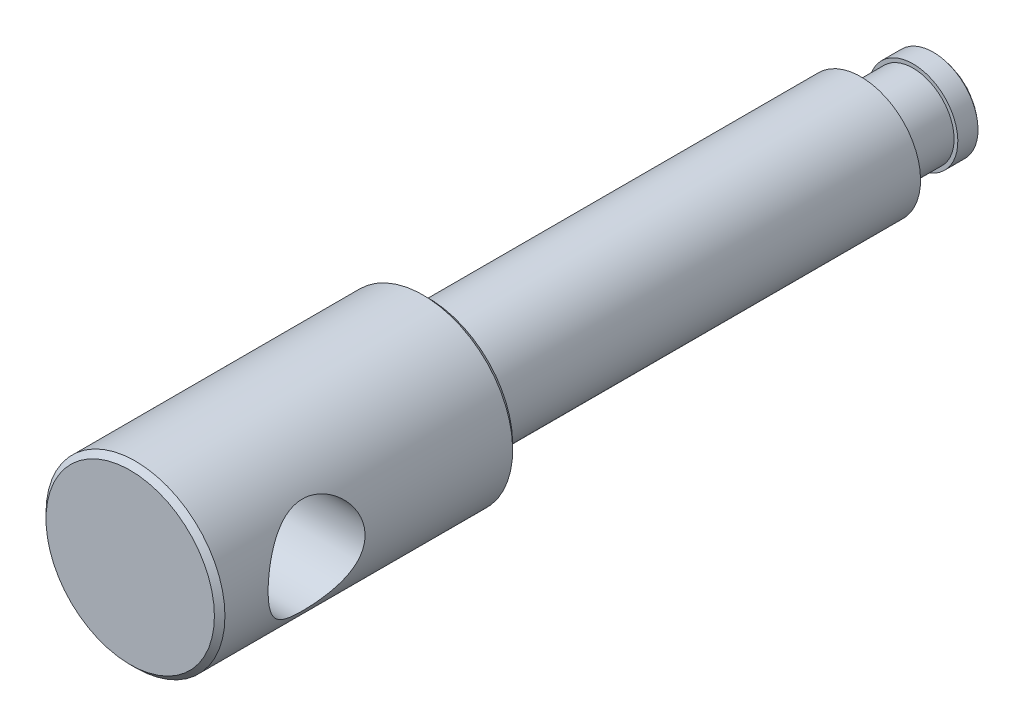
ISO-10303-21;
HEADER;
FILE_DESCRIPTION(('STEP AP214'),'2;1');
FILE_NAME('part.step','',(''),(''),'','','');
FILE_SCHEMA(('AUTOMOTIVE_DESIGN { 1 0 10303 214 1 1 1 1 }'));
ENDSEC;
DATA;
#1=APPLICATION_CONTEXT('core data for automotive mechanical design processes');
#2=APPLICATION_PROTOCOL_DEFINITION('international standard','automotive_design',2000,#1);
#3=PRODUCT_CONTEXT('',#1,'mechanical');
#4=PRODUCT('Part','Part','',(#3));
#5=PRODUCT_RELATED_PRODUCT_CATEGORY('part','',(#4));
#6=PRODUCT_DEFINITION_FORMATION('','',#4);
#7=PRODUCT_DEFINITION_CONTEXT('part definition',#1,'design');
#8=PRODUCT_DEFINITION('design','',#6,#7);
#9=PRODUCT_DEFINITION_SHAPE('','',#8);
#10=(LENGTH_UNIT() NAMED_UNIT(*) SI_UNIT(.MILLI.,.METRE.));
#11=(NAMED_UNIT(*) PLANE_ANGLE_UNIT() SI_UNIT($,.RADIAN.));
#12=(NAMED_UNIT(*) SI_UNIT($,.STERADIAN.) SOLID_ANGLE_UNIT());
#13=UNCERTAINTY_MEASURE_WITH_UNIT(LENGTH_MEASURE(1.E-05),#10,'distance_accuracy_value','');
#14=(GEOMETRIC_REPRESENTATION_CONTEXT(3) GLOBAL_UNCERTAINTY_ASSIGNED_CONTEXT((#13)) GLOBAL_UNIT_ASSIGNED_CONTEXT((#10,
#11,#12)) REPRESENTATION_CONTEXT('',''));
#15=CARTESIAN_POINT('',(0.,0.,0.));
#16=DIRECTION('',(0.,0.,1.));
#17=DIRECTION('',(1.,0.,0.));
#18=AXIS2_PLACEMENT_3D('',#15,#16,#17);
#19=CARTESIAN_POINT('',(0.,0.,9.));
#20=DIRECTION('',(-1.,0.,0.));
#21=DIRECTION('',(0.,1.,0.));
#22=AXIS2_PLACEMENT_3D('',#19,#20,#21);
#23=SPHERICAL_SURFACE('',#22,9.);
#24=CARTESIAN_POINT('',(0.,0.,2.29179606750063));
#25=DIRECTION('',(0.,0.,1.));
#26=DIRECTION('',(0.,-1.,0.));
#27=AXIS2_PLACEMENT_3D('',#24,#25,#26);
#28=CIRCLE('',#27,6.);
#29=CARTESIAN_POINT('',(0.,-6.,2.29179606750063));
#30=VERTEX_POINT('',#29);
#31=EDGE_CURVE('E112',#30,#30,#28,.T.);
#32=ORIENTED_EDGE('',*,*,#31,.F.);
#33=EDGE_LOOP('',(#32));
#34=FACE_BOUND('',#33,.T.);
#35=ADVANCED_FACE('F12',(#34),#23,.T.);
#36=CARTESIAN_POINT('',(0.,0.,0.));
#37=DIRECTION('',(0.,0.,1.));
#38=DIRECTION('',(0.,-1.,0.));
#39=AXIS2_PLACEMENT_3D('',#36,#37,#38);
#40=CYLINDRICAL_SURFACE('',#39,6.);
#41=CARTESIAN_POINT('',(0.,0.,5.));
#42=DIRECTION('',(0.,0.,1.));
#43=DIRECTION('',(0.,-1.,0.));
#44=AXIS2_PLACEMENT_3D('',#41,#42,#43);
#45=CIRCLE('',#44,6.);
#46=CARTESIAN_POINT('',(0.,-6.,5.));
#47=VERTEX_POINT('',#46);
#48=EDGE_CURVE('E113',#47,#47,#45,.F.);
#49=ORIENTED_EDGE('',*,*,#48,.T.);
#50=EDGE_LOOP('',(#49));
#51=FACE_BOUND('',#50,.T.);
#52=ORIENTED_EDGE('',*,*,#31,.T.);
#53=EDGE_LOOP('',(#52));
#54=FACE_BOUND('',#53,.T.);
#55=ADVANCED_FACE('F75',(#51,#54),#40,.T.);
#56=CARTESIAN_POINT('',(5.5,0.,5.));
#57=DIRECTION('',(0.,0.,-1.));
#58=DIRECTION('',(0.,1.,0.));
#59=AXIS2_PLACEMENT_3D('',#56,#57,#58);
#60=PLANE('',#59);
#61=CARTESIAN_POINT('',(0.,0.,5.));
#62=DIRECTION('',(0.,0.,1.));
#63=DIRECTION('',(0.,-1.,0.));
#64=AXIS2_PLACEMENT_3D('',#61,#62,#63);
#65=CIRCLE('',#64,5.5);
#66=CARTESIAN_POINT('',(0.,-5.5,5.));
#67=VERTEX_POINT('',#66);
#68=EDGE_CURVE('E94',#67,#67,#65,.T.);
#69=ORIENTED_EDGE('',*,*,#68,.F.);
#70=EDGE_LOOP('',(#69));
#71=FACE_BOUND('',#70,.T.);
#72=ORIENTED_EDGE('',*,*,#48,.F.);
#73=EDGE_LOOP('',(#72));
#74=FACE_BOUND('',#73,.T.);
#75=ADVANCED_FACE('F71',(#71,#74),#60,.F.);
#76=CARTESIAN_POINT('',(0.,0.,0.));
#77=DIRECTION('',(0.,0.,1.));
#78=DIRECTION('',(0.,-1.,0.));
#79=AXIS2_PLACEMENT_3D('',#76,#77,#78);
#80=CYLINDRICAL_SURFACE('',#79,5.5);
#81=CARTESIAN_POINT('',(0.,0.,10.5566243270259));
#82=DIRECTION('',(0.,0.,1.));
#83=DIRECTION('',(0.,-1.,0.));
#84=AXIS2_PLACEMENT_3D('',#81,#82,#83);
#85=CIRCLE('',#84,5.5);
#86=CARTESIAN_POINT('',(0.,-5.5,10.5566243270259));
#87=VERTEX_POINT('',#86);
#88=EDGE_CURVE('E90',#87,#87,#85,.T.);
#89=ORIENTED_EDGE('',*,*,#88,.F.);
#90=EDGE_LOOP('',(#89));
#91=FACE_BOUND('',#90,.T.);
#92=ORIENTED_EDGE('',*,*,#68,.T.);
#93=EDGE_LOOP('',(#92));
#94=FACE_BOUND('',#93,.T.);
#95=ADVANCED_FACE('F67',(#91,#94),#80,.T.);
#96=CARTESIAN_POINT('',(0.,0.,12.));
#97=DIRECTION('',(0.,0.,1.));
#98=DIRECTION('',(0.,-1.,0.));
#99=AXIS2_PLACEMENT_3D('',#96,#97,#98);
#100=CONICAL_SURFACE('',#99,8.,1.0471975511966);
#101=CARTESIAN_POINT('',(0.,0.,12.));
#102=DIRECTION('',(0.,0.,1.));
#103=DIRECTION('',(0.,-1.,0.));
#104=AXIS2_PLACEMENT_3D('',#101,#102,#103);
#105=CIRCLE('',#104,8.);
#106=CARTESIAN_POINT('',(0.,-8.,12.));
#107=VERTEX_POINT('',#106);
#108=EDGE_CURVE('E97',#107,#107,#105,.T.);
#109=ORIENTED_EDGE('',*,*,#108,.F.);
#110=EDGE_LOOP('',(#109));
#111=FACE_BOUND('',#110,.T.);
#112=ORIENTED_EDGE('',*,*,#88,.T.);
#113=EDGE_LOOP('',(#112));
#114=FACE_BOUND('',#113,.T.);
#115=ADVANCED_FACE('F63',(#111,#114),#100,.T.);
#116=CARTESIAN_POINT('',(0.,0.,0.));
#117=DIRECTION('',(0.,0.,1.));
#118=DIRECTION('',(0.,-1.,0.));
#119=AXIS2_PLACEMENT_3D('',#116,#117,#118);
#120=CYLINDRICAL_SURFACE('',#119,8.);
#121=CARTESIAN_POINT('',(0.,0.,70.));
#122=DIRECTION('',(0.,0.,1.));
#123=DIRECTION('',(0.,-1.,0.));
#124=AXIS2_PLACEMENT_3D('',#121,#122,#123);
#125=CIRCLE('',#124,8.);
#126=CARTESIAN_POINT('',(0.,-8.,70.));
#127=VERTEX_POINT('',#126);
#128=EDGE_CURVE('E93',#127,#127,#125,.F.);
#129=ORIENTED_EDGE('',*,*,#128,.T.);
#130=EDGE_LOOP('',(#129));
#131=FACE_BOUND('',#130,.T.);
#132=ORIENTED_EDGE('',*,*,#108,.T.);
#133=EDGE_LOOP('',(#132));
#134=FACE_BOUND('',#133,.T.);
#135=ADVANCED_FACE('F59',(#131,#134),#120,.T.);
#136=CARTESIAN_POINT('',(11.2928932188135,0.,70.));
#137=DIRECTION('',(0.,0.,1.));
#138=DIRECTION('',(0.,-1.,0.));
#139=AXIS2_PLACEMENT_3D('',#136,#137,#138);
#140=PLANE('',#139);
#141=CARTESIAN_POINT('',(0.,0.,70.));
#142=DIRECTION('',(0.,0.,1.));
#143=DIRECTION('',(0.,-1.,0.));
#144=AXIS2_PLACEMENT_3D('',#141,#142,#143);
#145=CIRCLE('',#144,11.2928932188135);
#146=CARTESIAN_POINT('',(0.,-11.2928932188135,70.));
#147=VERTEX_POINT('',#146);
#148=EDGE_CURVE('E100',#147,#147,#145,.T.);
#149=ORIENTED_EDGE('',*,*,#148,.F.);
#150=EDGE_LOOP('',(#149));
#151=FACE_BOUND('',#150,.T.);
#152=ORIENTED_EDGE('',*,*,#128,.F.);
#153=EDGE_LOOP('',(#152));
#154=FACE_BOUND('',#153,.T.);
#155=ADVANCED_FACE('F55',(#151,#154),#140,.F.);
#156=CARTESIAN_POINT('',(0.,0.,110.));
#157=DIRECTION('',(0.,0.,-1.));
#158=DIRECTION('',(0.,1.,0.));
#159=AXIS2_PLACEMENT_3D('',#156,#157,#158);
#160=PLANE('',#159);
#161=CARTESIAN_POINT('',(0.,0.,110.));
#162=DIRECTION('',(0.,0.,-1.));
#163=DIRECTION('',(1.,0.,0.));
#164=AXIS2_PLACEMENT_3D('',#161,#162,#163);
#165=CIRCLE('',#164,11.2928932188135);
#166=CARTESIAN_POINT('',(11.2928932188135,0.,110.));
#167=VERTEX_POINT('',#166);
#168=EDGE_CURVE('E86',#167,#167,#165,.T.);
#169=ORIENTED_EDGE('',*,*,#168,.F.);
#170=EDGE_LOOP('',(#169));
#171=FACE_BOUND('',#170,.T.);
#172=ADVANCED_FACE('F51',(#171),#160,.F.);
#173=CARTESIAN_POINT('',(0.,0.,70.7071067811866));
#174=DIRECTION('',(0.,0.,1.));
#175=DIRECTION('',(0.,-1.,0.));
#176=AXIS2_PLACEMENT_3D('',#173,#174,#175);
#177=CONICAL_SURFACE('',#176,12.,0.785398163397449);
#178=CARTESIAN_POINT('',(0.,0.,70.7071067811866));
#179=DIRECTION('',(0.,0.,1.));
#180=DIRECTION('',(0.,-1.,0.));
#181=AXIS2_PLACEMENT_3D('',#178,#179,#180);
#182=CIRCLE('',#181,12.);
#183=CARTESIAN_POINT('',(0.,-12.,70.7071067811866));
#184=VERTEX_POINT('',#183);
#185=EDGE_CURVE('E27',#184,#184,#182,.T.);
#186=ORIENTED_EDGE('',*,*,#185,.F.);
#187=EDGE_LOOP('',(#186));
#188=FACE_BOUND('',#187,.T.);
#189=ORIENTED_EDGE('',*,*,#148,.T.);
#190=EDGE_LOOP('',(#189));
#191=FACE_BOUND('',#190,.T.);
#192=ADVANCED_FACE('F47',(#188,#191),#177,.T.);
#193=CARTESIAN_POINT('',(0.,0.,109.292893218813));
#194=DIRECTION('',(0.,0.,-1.));
#195=DIRECTION('',(1.,0.,0.));
#196=AXIS2_PLACEMENT_3D('',#193,#194,#195);
#197=CONICAL_SURFACE('',#196,12.0000000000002,0.78539816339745);
#198=ORIENTED_EDGE('',*,*,#168,.T.);
#199=EDGE_LOOP('',(#198));
#200=FACE_BOUND('',#199,.T.);
#201=CARTESIAN_POINT('',(0.,0.,109.292893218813));
#202=DIRECTION('',(0.,0.,1.));
#203=DIRECTION('',(0.,-1.,0.));
#204=AXIS2_PLACEMENT_3D('',#201,#202,#203);
#205=CIRCLE('',#204,12.);
#206=CARTESIAN_POINT('',(0.,-12.,109.292893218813));
#207=VERTEX_POINT('',#206);
#208=EDGE_CURVE('E31',#207,#207,#205,.F.);
#209=ORIENTED_EDGE('',*,*,#208,.F.);
#210=EDGE_LOOP('',(#209));
#211=FACE_BOUND('',#210,.T.);
#212=ADVANCED_FACE('F42',(#200,#211),#197,.T.);
#213=CARTESIAN_POINT('',(0.,0.,0.));
#214=DIRECTION('',(0.,0.,1.));
#215=DIRECTION('',(0.,-1.,0.));
#216=AXIS2_PLACEMENT_3D('',#213,#214,#215);
#217=CYLINDRICAL_SURFACE('',#216,12.);
#218=CARTESIAN_POINT('',(-10.087120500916,6.5,97.));
#219=CARTESIAN_POINT('',(-10.087118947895,6.50000119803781,96.8328756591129));
#220=CARTESIAN_POINT('',(-10.0912874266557,6.49354678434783,96.6657648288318));
#221=CARTESIAN_POINT('',(-10.1077896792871,6.46782984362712,96.3328781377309));
#222=CARTESIAN_POINT('',(-10.1201263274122,6.44856280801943,96.1671027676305));
#223=CARTESIAN_POINT('',(-10.1524999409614,6.39747254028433,95.8380599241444));
#224=CARTESIAN_POINT('',(-10.1725465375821,6.36563360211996,95.6747958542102));
#225=CARTESIAN_POINT('',(-10.2195968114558,6.28981935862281,95.3520727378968));
#226=CARTESIAN_POINT('',(-10.2466035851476,6.24583865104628,95.1926154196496));
#227=CARTESIAN_POINT('',(-10.3064421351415,6.14659096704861,94.8795748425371));
#228=CARTESIAN_POINT('',(-10.3392345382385,6.09139991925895,94.7259599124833));
#229=CARTESIAN_POINT('',(-10.4097518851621,5.97009096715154,94.4242527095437));
#230=CARTESIAN_POINT('',(-10.4474786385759,5.9039690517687,94.2761624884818));
#231=CARTESIAN_POINT('',(-10.5664492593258,5.69005888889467,93.8412761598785));
#232=CARTESIAN_POINT('',(-10.6535335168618,5.52664700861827,93.5636176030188));
#233=CARTESIAN_POINT('',(-10.8437484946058,5.14421208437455,93.0111716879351));
#234=CARTESIAN_POINT('',(-10.9476156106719,4.9213132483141,92.7393209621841));
#235=CARTESIAN_POINT('',(-11.1021466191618,4.55630390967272,92.3609403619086));
#236=CARTESIAN_POINT('',(-11.1534773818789,4.42943405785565,92.2396454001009));
#237=CARTESIAN_POINT('',(-11.2545668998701,4.16588742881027,92.0073833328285));
#238=CARTESIAN_POINT('',(-11.3043253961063,4.02920904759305,91.8964179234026));
#239=CARTESIAN_POINT('',(-11.4051037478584,3.73493814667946,91.676778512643));
#240=CARTESIAN_POINT('',(-11.4558859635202,3.57655121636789,91.5690577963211));
#241=CARTESIAN_POINT('',(-11.5527965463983,3.24990680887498,91.3675127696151));
#242=CARTESIAN_POINT('',(-11.5989269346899,3.08165366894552,91.2736824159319));
#243=CARTESIAN_POINT('',(-11.6852214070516,2.7362872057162,91.100847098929));
#244=CARTESIAN_POINT('',(-11.725387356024,2.55917667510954,91.0218374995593));
#245=CARTESIAN_POINT('',(-11.798554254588,2.1973105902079,90.8795746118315));
#246=CARTESIAN_POINT('',(-11.8315561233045,2.01255602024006,90.8163193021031));
#247=CARTESIAN_POINT('',(-11.8870041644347,1.65215873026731,90.7109056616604));
#248=CARTESIAN_POINT('',(-11.9100894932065,1.47699280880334,90.6674520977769));
#249=CARTESIAN_POINT('',(-11.9486794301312,1.12284285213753,90.5951676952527));
#250=CARTESIAN_POINT('',(-11.9641844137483,0.943859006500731,90.566336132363));
#251=CARTESIAN_POINT('',(-11.9871526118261,0.583705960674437,90.5237240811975));
#252=CARTESIAN_POINT('',(-11.9946207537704,0.402538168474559,90.5099343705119));
#253=CARTESIAN_POINT('',(-12.0013074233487,0.0395375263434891,90.497584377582));
#254=CARTESIAN_POINT('',(-12.0005265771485,-0.142295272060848,90.499022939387));
#255=CARTESIAN_POINT('',(-11.9912428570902,-0.486463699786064,90.5161781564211));
#256=CARTESIAN_POINT('',(-11.9835355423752,-0.648896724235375,90.5304238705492));
#257=CARTESIAN_POINT('',(-11.9616756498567,-0.971862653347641,90.5710049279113));
#258=CARTESIAN_POINT('',(-11.94752092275,-1.13239490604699,90.5973443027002));
#259=CARTESIAN_POINT('',(-11.913104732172,-1.45034460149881,90.6617979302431));
#260=CARTESIAN_POINT('',(-11.8928454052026,-1.60776311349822,90.6999080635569));
#261=CARTESIAN_POINT('',(-11.8466723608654,-1.91860842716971,90.7875101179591));
#262=CARTESIAN_POINT('',(-11.820756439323,-2.07203364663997,90.8370064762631));
#263=CARTESIAN_POINT('',(-11.763526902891,-2.37561538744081,90.9474943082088));
#264=CARTESIAN_POINT('',(-11.7321572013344,-2.52571759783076,91.0086059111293));
#265=CARTESIAN_POINT('',(-11.6648916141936,-2.82013189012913,91.1414196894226));
#266=CARTESIAN_POINT('',(-11.6289942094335,-2.96444200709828,91.2131254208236));
#267=CARTESIAN_POINT('',(-11.5156109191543,-3.38759543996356,91.4432730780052));
#268=CARTESIAN_POINT('',(-11.4323975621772,-3.65684755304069,91.6168137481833));
#269=CARTESIAN_POINT('',(-11.2478649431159,-4.19213402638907,92.0200480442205));
#270=CARTESIAN_POINT('',(-11.1455615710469,-4.45481814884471,92.2537387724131));
#271=CARTESIAN_POINT('',(-10.9911490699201,-4.81788921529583,92.6332291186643));
#272=CARTESIAN_POINT('',(-10.9394753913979,-4.933837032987,92.7646727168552));
#273=CARTESIAN_POINT('',(-10.8370351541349,-5.15494824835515,93.0367657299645));
#274=CARTESIAN_POINT('',(-10.7862687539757,-5.26010977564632,93.1774167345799));
#275=CARTESIAN_POINT('',(-10.6828047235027,-5.46737700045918,93.4794745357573));
#276=CARTESIAN_POINT('',(-10.6303021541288,-5.56848689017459,93.6416327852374));
#277=CARTESIAN_POINT('',(-10.5296797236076,-5.75649288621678,93.9751992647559));
#278=CARTESIAN_POINT('',(-10.4815578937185,-5.84339539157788,94.1466032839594));
#279=CARTESIAN_POINT('',(-10.3914773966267,-6.00212687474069,94.4976892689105));
#280=CARTESIAN_POINT('',(-10.349514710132,-6.07396569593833,94.677365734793));
#281=CARTESIAN_POINT('',(-10.2734696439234,-6.20172232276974,95.0439097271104));
#282=CARTESIAN_POINT('',(-10.2393860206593,-6.25764264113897,95.2307761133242));
#283=CARTESIAN_POINT('',(-10.183067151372,-6.34884087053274,95.5948225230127));
#284=CARTESIAN_POINT('',(-10.1600959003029,-6.38542375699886,95.7715614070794));
#285=CARTESIAN_POINT('',(-10.1231525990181,-6.44383305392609,96.1283981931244));
#286=CARTESIAN_POINT('',(-10.1091799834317,-6.46566039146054,96.3084958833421));
#287=CARTESIAN_POINT('',(-10.0908950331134,-6.49416095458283,96.67021537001));
#288=CARTESIAN_POINT('',(-10.0865740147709,-6.50084780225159,96.8518356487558));
#289=CARTESIAN_POINT('',(-10.0877775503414,-6.49898061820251,97.2149553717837));
#290=CARTESIAN_POINT('',(-10.0933011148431,-6.49042811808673,97.3964548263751));
#291=CARTESIAN_POINT('',(-10.1124808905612,-6.46049409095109,97.7323705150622));
#292=CARTESIAN_POINT('',(-10.1248969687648,-6.44106571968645,97.8870373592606));
#293=CARTESIAN_POINT('',(-10.1563891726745,-6.39129308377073,98.193964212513));
#294=CARTESIAN_POINT('',(-10.1754674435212,-6.36094530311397,98.3462234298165));
#295=CARTESIAN_POINT('',(-10.2196651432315,-6.28968973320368,98.6473418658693));
#296=CARTESIAN_POINT('',(-10.24478424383,-6.24878251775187,98.796201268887));
#297=CARTESIAN_POINT('',(-10.3003063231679,-6.15683127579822,99.0897666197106));
#298=CARTESIAN_POINT('',(-10.3307114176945,-6.10578318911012,99.2344708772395));
#299=CARTESIAN_POINT('',(-10.4314159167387,-5.93327889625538,99.6735187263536));
#300=CARTESIAN_POINT('',(-10.5092162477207,-5.79551066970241,99.9599297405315));
#301=CARTESIAN_POINT('',(-10.6762160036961,-5.48178778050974,100.50710512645));
#302=CARTESIAN_POINT('',(-10.7654211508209,-5.30581391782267,100.767856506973));
#303=CARTESIAN_POINT('',(-10.9615933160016,-4.88917754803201,101.298392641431));
#304=CARTESIAN_POINT('',(-11.0691920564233,-4.64273975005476,101.563473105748));
#305=CARTESIAN_POINT('',(-11.2261517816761,-4.24196259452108,101.928337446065));
#306=CARTESIAN_POINT('',(-11.2777643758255,-4.10308206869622,102.044565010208));
#307=CARTESIAN_POINT('',(-11.378301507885,-3.81542023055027,102.265494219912));
#308=CARTESIAN_POINT('',(-11.427225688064,-3.66663760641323,102.370194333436));
#309=CARTESIAN_POINT('',(-11.5233155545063,-3.35281482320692,102.571805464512));
#310=CARTESIAN_POINT('',(-11.5702947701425,-3.18734081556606,102.668130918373));
#311=CARTESIAN_POINT('',(-11.6586044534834,-2.8474119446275,102.846284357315));
#312=CARTESIAN_POINT('',(-11.699937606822,-2.67296140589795,102.928119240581));
#313=CARTESIAN_POINT('',(-11.7757388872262,-2.3162883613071,103.076354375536));
#314=CARTESIAN_POINT('',(-11.8102108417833,-2.13407025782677,103.142763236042));
#315=CARTESIAN_POINT('',(-11.8712409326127,-1.76321621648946,103.259299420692));
#316=CARTESIAN_POINT('',(-11.897800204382,-1.57458120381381,103.309429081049));
#317=CARTESIAN_POINT('',(-11.9399132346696,-1.21177627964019,103.388468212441));
#318=CARTESIAN_POINT('',(-11.9563044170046,-1.03805633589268,103.419003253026));
#319=CARTESIAN_POINT('',(-11.9815348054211,-0.68816884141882,103.465877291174));
#320=CARTESIAN_POINT('',(-11.9903745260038,-0.512001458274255,103.482217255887));
#321=CARTESIAN_POINT('',(-12.0002498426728,-0.158776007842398,103.500465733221));
#322=CARTESIAN_POINT('',(-12.0012886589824,0.0182816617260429,103.502380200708));
#323=CARTESIAN_POINT('',(-11.9955405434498,0.371831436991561,103.491765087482));
#324=CARTESIAN_POINT('',(-11.9887539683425,0.548323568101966,103.479236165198));
#325=CARTESIAN_POINT('',(-11.9684587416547,0.884220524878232,103.441601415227));
#326=CARTESIAN_POINT('',(-11.955574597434,1.04379585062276,103.417662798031));
#327=CARTESIAN_POINT('',(-11.9237226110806,1.36019350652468,103.358128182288));
#328=CARTESIAN_POINT('',(-11.9047527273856,1.51701489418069,103.322528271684));
#329=CARTESIAN_POINT('',(-11.8611656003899,1.82680418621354,103.240069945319));
#330=CARTESIAN_POINT('',(-11.8365501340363,1.97977328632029,103.19321507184));
#331=CARTESIAN_POINT('',(-11.7821936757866,2.28108822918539,103.088684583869));
#332=CARTESIAN_POINT('',(-11.7524506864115,2.42943224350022,103.031004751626));
#333=CARTESIAN_POINT('',(-11.6873202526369,2.72587240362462,102.903100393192));
#334=CARTESIAN_POINT('',(-11.6517694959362,2.87377152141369,102.832502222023));
#335=CARTESIAN_POINT('',(-11.5765941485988,3.16304240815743,102.680832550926));
#336=CARTESIAN_POINT('',(-11.5369681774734,3.30441194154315,102.599757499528));
#337=CARTESIAN_POINT('',(-11.4131894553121,3.71775123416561,102.341701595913));
#338=CARTESIAN_POINT('',(-11.324101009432,3.97910456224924,102.149823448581));
#339=CARTESIAN_POINT('',(-11.1293540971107,4.49693418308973,101.707057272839));
#340=CARTESIAN_POINT('',(-11.0229598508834,4.74953907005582,101.451955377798));
#341=CARTESIAN_POINT('',(-10.865503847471,5.09479556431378,101.040448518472));
#342=CARTESIAN_POINT('',(-10.8133263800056,5.20435968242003,100.898323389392));
#343=CARTESIAN_POINT('',(-10.7110504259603,5.41172260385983,100.60492903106));
#344=CARTESIAN_POINT('',(-10.6609522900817,5.50951942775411,100.453658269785));
#345=CARTESIAN_POINT('',(-10.561377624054,5.69819013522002,100.133250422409));
#346=CARTESIAN_POINT('',(-10.512122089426,5.78828717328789,99.963586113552));
#347=CARTESIAN_POINT('',(-10.4194004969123,5.95357648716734,99.6157183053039));
#348=CARTESIAN_POINT('',(-10.3759314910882,6.02877636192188,99.4375192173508));
#349=CARTESIAN_POINT('',(-10.2966205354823,6.16325352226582,99.0740667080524));
#350=CARTESIAN_POINT('',(-10.2607600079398,6.22256968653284,98.8888318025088));
#351=CARTESIAN_POINT('',(-10.1981899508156,6.324595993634,98.5124375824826));
#352=CARTESIAN_POINT('',(-10.1714744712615,6.36731693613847,98.3212822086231));
#353=CARTESIAN_POINT('',(-10.1293959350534,6.43403702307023,97.9426526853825));
#354=CARTESIAN_POINT('',(-10.1136130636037,6.45873074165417,97.7553479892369));
#355=CARTESIAN_POINT('',(-10.0924761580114,6.49171165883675,97.3786897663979));
#356=CARTESIAN_POINT('',(-10.0871222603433,6.49999864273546,97.1893362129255));
#357=CARTESIAN_POINT('',(-10.087120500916,6.5,97.));
#358=B_SPLINE_CURVE_WITH_KNOTS('',3,(#218,#219,#220,#221,#222,#223,#224,#225,#226,#227,#228,
#229,#230,#231,#232,#233,#234,#235,#236,#237,#238,#239,#240,#241,#242,#243,#244,#245,#246,#247,
#248,#249,#250,#251,#252,#253,#254,#255,#256,#257,#258,#259,#260,#261,#262,#263,#264,#265,#266,
#267,#268,#269,#270,#271,#272,#273,#274,#275,#276,#277,#278,#279,#280,#281,#282,#283,#284,#285,
#286,#287,#288,#289,#290,#291,#292,#293,#294,#295,#296,#297,#298,#299,#300,#301,#302,#303,#304,
#305,#306,#307,#308,#309,#310,#311,#312,#313,#314,#315,#316,#317,#318,#319,#320,#321,#322,#323,
#324,#325,#326,#327,#328,#329,#330,#331,#332,#333,#334,#335,#336,#337,#338,#339,#340,#341,#342,
#343,#344,#345,#346,#347,#348,#349,#350,#351,#352,#353,#354,#355,#356,#357),.UNSPECIFIED.,.T.,
.F.,(4,2,2,2,2,2,2,2,2,2,2,2,2,2,2,2,2,2,2,2,2,2,2,2,2,2,2,2,2,2,2,2,2,2,2,2,2,2,2,2,2,2,2,2,2,
2,2,2,2,2,2,2,2,2,2,2,2,2,2,2,2,2,2,2,2,2,2,2,2,4),(0.,0.501175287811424,1.00252702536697,
1.50450709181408,2.00671086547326,2.50562026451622,3.00471314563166,4.0021156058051,
5.09706524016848,5.64523335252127,6.19349131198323,6.78721913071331,7.38068787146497,
7.97397065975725,8.56717728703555,9.11225779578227,9.65731130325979,10.2020304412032,
10.7467082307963,11.2358435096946,11.7251419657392,12.2142693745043,12.7035877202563,
13.1982731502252,13.6931250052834,14.6822316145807,15.7759181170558,16.3236710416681,
16.8715187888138,17.4653089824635,18.0588309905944,18.6519639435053,19.2450032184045,
19.7900148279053,20.3349921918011,20.8794790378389,21.423911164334,21.8924997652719,
22.3612393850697,22.8299535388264,23.2988557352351,24.2763506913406,25.2543380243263,
26.3817148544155,26.9461447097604,27.5106494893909,28.1013064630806,28.6916814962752,
29.2817262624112,29.8716863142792,30.4023944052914,30.9330663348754,31.4635191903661,
31.9939478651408,32.4790142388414,32.9642435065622,33.449320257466,33.9345864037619,
34.4371369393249,34.9398582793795,35.9447953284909,37.0630240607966,37.6231922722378,
38.1834545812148,38.7776141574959,39.3714698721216,39.9638584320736,40.5558608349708,
41.123638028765,41.6914226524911),.UNSPECIFIED.);
#359=CARTESIAN_POINT('',(-10.087120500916,6.5,97.));
#360=VERTEX_POINT('',#359);
#361=EDGE_CURVE('E23',#360,#360,#358,.T.);
#362=ORIENTED_EDGE('',*,*,#361,.F.);
#363=EDGE_LOOP('',(#362));
#364=FACE_BOUND('',#363,.T.);
#365=ORIENTED_EDGE('',*,*,#208,.T.);
#366=EDGE_LOOP('',(#365));
#367=FACE_BOUND('',#366,.T.);
#368=CARTESIAN_POINT('',(10.087120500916,6.5,97.));
#369=CARTESIAN_POINT('',(10.087118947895,6.50000119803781,97.1671243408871));
#370=CARTESIAN_POINT('',(10.0912874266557,6.49354678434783,97.3342351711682));
#371=CARTESIAN_POINT('',(10.1077896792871,6.46782984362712,97.6671218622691));
#372=CARTESIAN_POINT('',(10.1201263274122,6.44856280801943,97.8328972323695));
#373=CARTESIAN_POINT('',(10.1524999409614,6.39747254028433,98.1619400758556));
#374=CARTESIAN_POINT('',(10.1725465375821,6.36563360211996,98.3252041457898));
#375=CARTESIAN_POINT('',(10.2195968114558,6.28981935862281,98.6479272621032));
#376=CARTESIAN_POINT('',(10.2466035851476,6.24583865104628,98.8073845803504));
#377=CARTESIAN_POINT('',(10.3064421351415,6.14659096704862,99.1204251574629));
#378=CARTESIAN_POINT('',(10.3392345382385,6.09139991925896,99.2740400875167));
#379=CARTESIAN_POINT('',(10.4097518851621,5.97009096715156,99.5757472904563));
#380=CARTESIAN_POINT('',(10.4474786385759,5.90396905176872,99.7238375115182));
#381=CARTESIAN_POINT('',(10.5664492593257,5.6900588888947,100.158723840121));
#382=CARTESIAN_POINT('',(10.6535335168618,5.52664700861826,100.436382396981));
#383=CARTESIAN_POINT('',(10.8437484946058,5.14421208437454,100.988828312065));
#384=CARTESIAN_POINT('',(10.9476156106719,4.92131324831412,101.260679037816));
#385=CARTESIAN_POINT('',(11.1021466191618,4.55630390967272,101.639059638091));
#386=CARTESIAN_POINT('',(11.1534773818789,4.42943405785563,101.760354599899));
#387=CARTESIAN_POINT('',(11.2545668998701,4.16588742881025,101.992616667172));
#388=CARTESIAN_POINT('',(11.3043253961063,4.02920904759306,102.103582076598));
#389=CARTESIAN_POINT('',(11.4051037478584,3.73493814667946,102.323221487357));
#390=CARTESIAN_POINT('',(11.4558859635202,3.57655121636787,102.430942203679));
#391=CARTESIAN_POINT('',(11.5527965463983,3.24990680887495,102.632487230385));
#392=CARTESIAN_POINT('',(11.5989269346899,3.08165366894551,102.726317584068));
#393=CARTESIAN_POINT('',(11.6852214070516,2.73628720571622,102.899152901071));
#394=CARTESIAN_POINT('',(11.725387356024,2.55917667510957,102.978162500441));
#395=CARTESIAN_POINT('',(11.798554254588,2.19731059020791,103.120425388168));
#396=CARTESIAN_POINT('',(11.8315561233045,2.01255602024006,103.183680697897));
#397=CARTESIAN_POINT('',(11.8870041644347,1.65215873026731,103.28909433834));
#398=CARTESIAN_POINT('',(11.9100894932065,1.47699280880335,103.332547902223));
#399=CARTESIAN_POINT('',(11.9486794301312,1.12284285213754,103.404832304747));
#400=CARTESIAN_POINT('',(11.9641844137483,0.943859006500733,103.433663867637));
#401=CARTESIAN_POINT('',(11.9871526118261,0.583705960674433,103.476275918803));
#402=CARTESIAN_POINT('',(11.9946207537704,0.402538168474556,103.490065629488));
#403=CARTESIAN_POINT('',(12.0013074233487,0.0395375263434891,103.502415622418));
#404=CARTESIAN_POINT('',(12.0005265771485,-0.142295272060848,103.500977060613));
#405=CARTESIAN_POINT('',(11.9912428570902,-0.486463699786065,103.483821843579));
#406=CARTESIAN_POINT('',(11.9835355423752,-0.648896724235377,103.469576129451));
#407=CARTESIAN_POINT('',(11.9616756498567,-0.971862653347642,103.428995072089));
#408=CARTESIAN_POINT('',(11.94752092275,-1.13239490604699,103.4026556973));
#409=CARTESIAN_POINT('',(11.913104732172,-1.45034460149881,103.338202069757));
#410=CARTESIAN_POINT('',(11.8928454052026,-1.60776311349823,103.300091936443));
#411=CARTESIAN_POINT('',(11.8466723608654,-1.91860842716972,103.212489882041));
#412=CARTESIAN_POINT('',(11.820756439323,-2.07203364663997,103.162993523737));
#413=CARTESIAN_POINT('',(11.763526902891,-2.37561538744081,103.052505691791));
#414=CARTESIAN_POINT('',(11.7321572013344,-2.52571759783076,102.991394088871));
#415=CARTESIAN_POINT('',(11.6648916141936,-2.82013189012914,102.858580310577));
#416=CARTESIAN_POINT('',(11.6289942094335,-2.96444200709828,102.786874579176));
#417=CARTESIAN_POINT('',(11.5156109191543,-3.38759543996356,102.556726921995));
#418=CARTESIAN_POINT('',(11.4323975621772,-3.65684755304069,102.383186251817));
#419=CARTESIAN_POINT('',(11.2478649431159,-4.19213402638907,101.97995195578));
#420=CARTESIAN_POINT('',(11.1455615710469,-4.45481814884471,101.746261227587));
#421=CARTESIAN_POINT('',(10.9911490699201,-4.81788921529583,101.366770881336));
#422=CARTESIAN_POINT('',(10.9394753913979,-4.933837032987,101.235327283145));
#423=CARTESIAN_POINT('',(10.8370351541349,-5.15494824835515,100.963234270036));
#424=CARTESIAN_POINT('',(10.7862687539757,-5.26010977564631,100.82258326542));
#425=CARTESIAN_POINT('',(10.6828047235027,-5.46737700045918,100.520525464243));
#426=CARTESIAN_POINT('',(10.6303021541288,-5.56848689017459,100.358367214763));
#427=CARTESIAN_POINT('',(10.5296797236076,-5.75649288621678,100.024800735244));
#428=CARTESIAN_POINT('',(10.4815578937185,-5.84339539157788,99.8533967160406));
#429=CARTESIAN_POINT('',(10.3914773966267,-6.00212687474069,99.5023107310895));
#430=CARTESIAN_POINT('',(10.349514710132,-6.07396569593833,99.322634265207));
#431=CARTESIAN_POINT('',(10.2734696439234,-6.20172232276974,98.9560902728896));
#432=CARTESIAN_POINT('',(10.2393860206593,-6.25764264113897,98.7692238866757));
#433=CARTESIAN_POINT('',(10.183067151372,-6.34884087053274,98.4051774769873));
#434=CARTESIAN_POINT('',(10.1600959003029,-6.38542375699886,98.2284385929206));
#435=CARTESIAN_POINT('',(10.1231525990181,-6.44383305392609,97.8716018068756));
#436=CARTESIAN_POINT('',(10.1091799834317,-6.46566039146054,97.6915041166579));
#437=CARTESIAN_POINT('',(10.0908950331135,-6.49416095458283,97.32978462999));
#438=CARTESIAN_POINT('',(10.0865740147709,-6.50084780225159,97.1481643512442));
#439=CARTESIAN_POINT('',(10.0877775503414,-6.49898061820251,96.7850446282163));
#440=CARTESIAN_POINT('',(10.0933011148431,-6.49042811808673,96.6035451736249));
#441=CARTESIAN_POINT('',(10.1124808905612,-6.46049409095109,96.2676294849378));
#442=CARTESIAN_POINT('',(10.1248969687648,-6.44106571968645,96.1129626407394));
#443=CARTESIAN_POINT('',(10.1563891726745,-6.39129308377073,95.806035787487));
#444=CARTESIAN_POINT('',(10.1754674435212,-6.36094530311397,95.6537765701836));
#445=CARTESIAN_POINT('',(10.2196651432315,-6.28968973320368,95.3526581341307));
#446=CARTESIAN_POINT('',(10.24478424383,-6.24878251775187,95.203798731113));
#447=CARTESIAN_POINT('',(10.3003063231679,-6.15683127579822,94.9102333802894));
#448=CARTESIAN_POINT('',(10.3307114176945,-6.10578318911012,94.7655291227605));
#449=CARTESIAN_POINT('',(10.4314159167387,-5.93327889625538,94.3264812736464));
#450=CARTESIAN_POINT('',(10.5092162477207,-5.79551066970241,94.0400702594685));
#451=CARTESIAN_POINT('',(10.6762160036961,-5.48178778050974,93.4928948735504));
#452=CARTESIAN_POINT('',(10.7654211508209,-5.30581391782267,93.2321434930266));
#453=CARTESIAN_POINT('',(10.9615933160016,-4.88917754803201,92.7016073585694));
#454=CARTESIAN_POINT('',(11.0691920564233,-4.64273975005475,92.4365268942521));
#455=CARTESIAN_POINT('',(11.2261517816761,-4.24196259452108,92.0716625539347));
#456=CARTESIAN_POINT('',(11.2777643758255,-4.10308206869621,91.9554349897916));
#457=CARTESIAN_POINT('',(11.378301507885,-3.81542023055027,91.7345057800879));
#458=CARTESIAN_POINT('',(11.427225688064,-3.66663760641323,91.6298056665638));
#459=CARTESIAN_POINT('',(11.5233155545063,-3.35281482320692,91.4281945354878));
#460=CARTESIAN_POINT('',(11.5702947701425,-3.18734081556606,91.3318690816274));
#461=CARTESIAN_POINT('',(11.6586044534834,-2.8474119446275,91.1537156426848));
#462=CARTESIAN_POINT('',(11.699937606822,-2.67296140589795,91.0718807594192));
#463=CARTESIAN_POINT('',(11.7757388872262,-2.3162883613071,90.9236456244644));
#464=CARTESIAN_POINT('',(11.8102108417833,-2.13407025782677,90.8572367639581));
#465=CARTESIAN_POINT('',(11.8712409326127,-1.76321621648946,90.7407005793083));
#466=CARTESIAN_POINT('',(11.897800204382,-1.57458120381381,90.6905709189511));
#467=CARTESIAN_POINT('',(11.9399132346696,-1.21177627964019,90.6115317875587));
#468=CARTESIAN_POINT('',(11.9563044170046,-1.03805633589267,90.5809967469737));
#469=CARTESIAN_POINT('',(11.9815348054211,-0.688168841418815,90.5341227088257));
#470=CARTESIAN_POINT('',(11.9903745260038,-0.512001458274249,90.5177827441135));
#471=CARTESIAN_POINT('',(12.0002498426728,-0.158776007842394,90.499534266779));
#472=CARTESIAN_POINT('',(12.0012886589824,0.0182816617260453,90.497619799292));
#473=CARTESIAN_POINT('',(11.9955405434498,0.371831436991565,90.5082349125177));
#474=CARTESIAN_POINT('',(11.9887539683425,0.548323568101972,90.5207638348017));
#475=CARTESIAN_POINT('',(11.9684587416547,0.884220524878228,90.5583985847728));
#476=CARTESIAN_POINT('',(11.955574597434,1.04379585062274,90.5823372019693));
#477=CARTESIAN_POINT('',(11.9237226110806,1.36019350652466,90.6418718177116));
#478=CARTESIAN_POINT('',(11.9047527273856,1.51701489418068,90.6774717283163));
#479=CARTESIAN_POINT('',(11.8611656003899,1.82680418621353,90.7599300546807));
#480=CARTESIAN_POINT('',(11.8365501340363,1.97977328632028,90.8067849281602));
#481=CARTESIAN_POINT('',(11.7821936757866,2.28108822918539,90.9113154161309));
#482=CARTESIAN_POINT('',(11.7524506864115,2.42943224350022,90.9689952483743));
#483=CARTESIAN_POINT('',(11.6873202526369,2.72587240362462,91.0968996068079));
#484=CARTESIAN_POINT('',(11.6517694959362,2.87377152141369,91.1674977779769));
#485=CARTESIAN_POINT('',(11.5765941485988,3.16304240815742,91.319167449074));
#486=CARTESIAN_POINT('',(11.5369681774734,3.30441194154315,91.4002425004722));
#487=CARTESIAN_POINT('',(11.4131894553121,3.71775123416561,91.658298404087));
#488=CARTESIAN_POINT('',(11.324101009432,3.97910456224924,91.8501765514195));
#489=CARTESIAN_POINT('',(11.1293540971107,4.49693418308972,92.2929427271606));
#490=CARTESIAN_POINT('',(11.0229598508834,4.74953907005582,92.5480446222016));
#491=CARTESIAN_POINT('',(10.865503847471,5.09479556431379,92.9595514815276));
#492=CARTESIAN_POINT('',(10.8133263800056,5.20435968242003,93.1016766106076));
#493=CARTESIAN_POINT('',(10.7110504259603,5.41172260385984,93.3950709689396));
#494=CARTESIAN_POINT('',(10.6609522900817,5.50951942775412,93.5463417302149));
#495=CARTESIAN_POINT('',(10.561377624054,5.69819013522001,93.8667495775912));
#496=CARTESIAN_POINT('',(10.5121220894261,5.78828717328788,94.036413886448));
#497=CARTESIAN_POINT('',(10.4194004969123,5.95357648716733,94.3842816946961));
#498=CARTESIAN_POINT('',(10.3759314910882,6.02877636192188,94.5624807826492));
#499=CARTESIAN_POINT('',(10.2966205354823,6.16325352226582,94.9259332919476));
#500=CARTESIAN_POINT('',(10.2607600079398,6.22256968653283,95.1111681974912));
#501=CARTESIAN_POINT('',(10.1981899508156,6.324595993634,95.4875624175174));
#502=CARTESIAN_POINT('',(10.1714744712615,6.36731693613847,95.6787177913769));
#503=CARTESIAN_POINT('',(10.1293959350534,6.43403702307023,96.0573473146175));
#504=CARTESIAN_POINT('',(10.1136130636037,6.45873074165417,96.2446520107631));
#505=CARTESIAN_POINT('',(10.0924761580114,6.49171165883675,96.6213102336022));
#506=CARTESIAN_POINT('',(10.0871222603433,6.49999864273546,96.8106637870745));
#507=CARTESIAN_POINT('',(10.087120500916,6.5,97.));
#508=B_SPLINE_CURVE_WITH_KNOTS('',3,(#368,#369,#370,#371,#372,#373,#374,#375,#376,#377,#378,
#379,#380,#381,#382,#383,#384,#385,#386,#387,#388,#389,#390,#391,#392,#393,#394,#395,#396,#397,
#398,#399,#400,#401,#402,#403,#404,#405,#406,#407,#408,#409,#410,#411,#412,#413,#414,#415,#416,
#417,#418,#419,#420,#421,#422,#423,#424,#425,#426,#427,#428,#429,#430,#431,#432,#433,#434,#435,
#436,#437,#438,#439,#440,#441,#442,#443,#444,#445,#446,#447,#448,#449,#450,#451,#452,#453,#454,
#455,#456,#457,#458,#459,#460,#461,#462,#463,#464,#465,#466,#467,#468,#469,#470,#471,#472,#473,
#474,#475,#476,#477,#478,#479,#480,#481,#482,#483,#484,#485,#486,#487,#488,#489,#490,#491,#492,
#493,#494,#495,#496,#497,#498,#499,#500,#501,#502,#503,#504,#505,#506,#507),.UNSPECIFIED.,.T.,
.F.,(4,2,2,2,2,2,2,2,2,2,2,2,2,2,2,2,2,2,2,2,2,2,2,2,2,2,2,2,2,2,2,2,2,2,2,2,2,2,2,2,2,2,2,2,2,
2,2,2,2,2,2,2,2,2,2,2,2,2,2,2,2,2,2,2,2,2,2,2,2,4),(0.,0.501175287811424,1.00252702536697,
1.50450709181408,2.00671086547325,2.50562026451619,3.00471314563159,4.002115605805,
5.09706524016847,5.6452333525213,6.19349131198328,6.78721913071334,7.38068787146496,
7.97397065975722,8.56717728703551,9.11225779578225,9.65731130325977,10.2020304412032,
10.7467082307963,11.2358435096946,11.7251419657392,12.2142693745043,12.7035877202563,
13.1982731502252,13.6931250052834,14.6822316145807,15.7759181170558,16.323671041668,
16.8715187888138,17.4653089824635,18.0588309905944,18.6519639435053,19.2450032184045,
19.7900148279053,20.3349921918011,20.8794790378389,21.423911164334,21.8924997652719,
22.3612393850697,22.8299535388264,23.2988557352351,24.2763506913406,25.2543380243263,
26.3817148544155,26.9461447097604,27.5106494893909,28.1013064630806,28.6916814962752,
29.2817262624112,29.8716863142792,30.4023944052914,30.9330663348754,31.4635191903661,
31.9939478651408,32.4790142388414,32.9642435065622,33.449320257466,33.9345864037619,
34.4371369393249,34.9398582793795,35.944795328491,37.0630240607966,37.6231922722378,
38.1834545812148,38.7776141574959,39.3714698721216,39.9638584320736,40.5558608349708,
41.1236380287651,41.6914226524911),.UNSPECIFIED.);
#509=CARTESIAN_POINT('',(10.087120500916,6.5,97.));
#510=VERTEX_POINT('',#509);
#511=EDGE_CURVE('E8',#510,#510,#508,.T.);
#512=ORIENTED_EDGE('',*,*,#511,.F.);
#513=EDGE_LOOP('',(#512));
#514=FACE_BOUND('',#513,.T.);
#515=ORIENTED_EDGE('',*,*,#185,.T.);
#516=EDGE_LOOP('',(#515));
#517=FACE_BOUND('',#516,.T.);
#518=ADVANCED_FACE('F38',(#364,#367,#514,#517),#217,.T.);
#519=CARTESIAN_POINT('',(-24.0022539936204,0.,97.));
#520=DIRECTION('',(1.,0.,0.));
#521=DIRECTION('',(0.,1.,0.));
#522=AXIS2_PLACEMENT_3D('',#519,#520,#521);
#523=CYLINDRICAL_SURFACE('',#522,6.5);
#524=ORIENTED_EDGE('',*,*,#361,.T.);
#525=EDGE_LOOP('',(#524));
#526=FACE_BOUND('',#525,.T.);
#527=ORIENTED_EDGE('',*,*,#511,.T.);
#528=EDGE_LOOP('',(#527));
#529=FACE_BOUND('',#528,.T.);
#530=ADVANCED_FACE('F14',(#526,#529),#523,.F.);
#531=CLOSED_SHELL('',(#35,#55,#75,#95,#115,#135,#155,#172,#192,#212,#518,#530));
#532=MANIFOLD_SOLID_BREP('B1',#531);
#533=ADVANCED_BREP_SHAPE_REPRESENTATION('',(#18,#532),#14);
#534=SHAPE_DEFINITION_REPRESENTATION(#9,#533);
ENDSEC;
END-ISO-10303-21;
